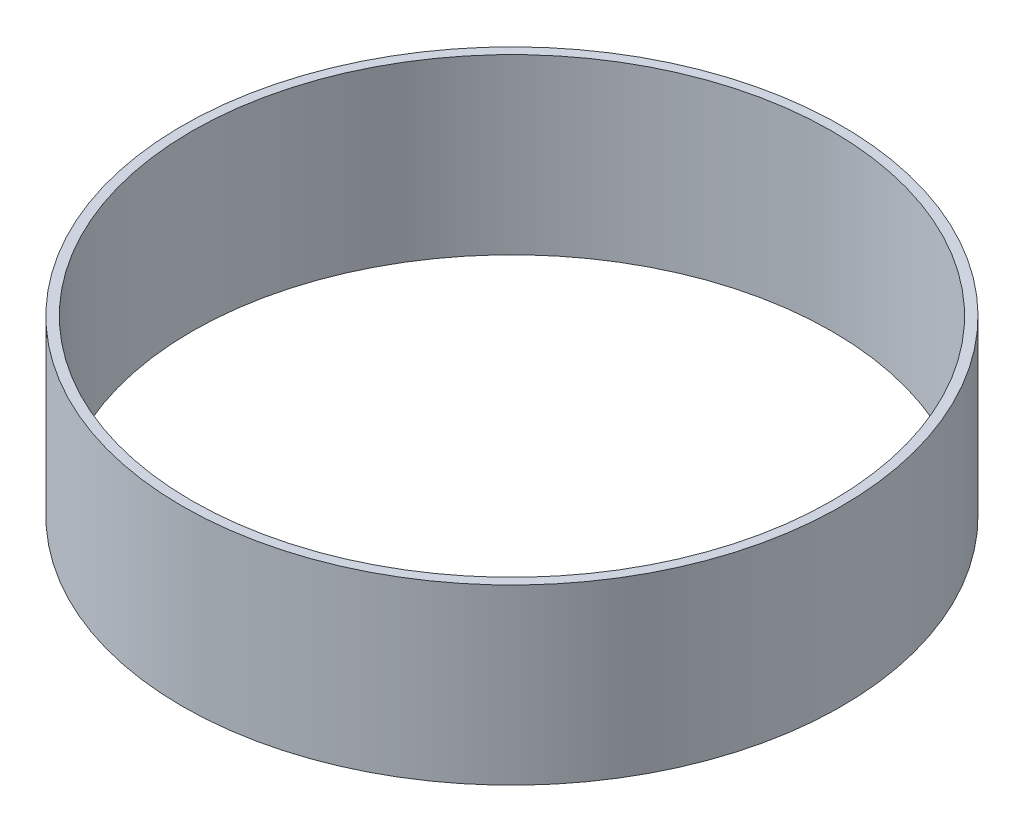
from build123d import *

# Parameters (mm, degrees)
SKETCH2_R           = 33
SKETCH2_R_2         = 32.05
BOSS_EXTRUDE2_DEPTH = 17.36


with BuildPart() as part:
    # Sketch2 → Boss-Extrude2 (new body)
    with BuildSketch(Plane(origin=(0, 0, 0), x_dir=(1, 0, 0), z_dir=(0, 1, 0))):
        with Locations(Location((0, 0, 0), (0, 0, 270))):
            Circle(SKETCH2_R)
        with Locations(Location((0, 0, 0), (0, 0, 270))):
            Circle(SKETCH2_R_2, mode=Mode.SUBTRACT)
    extrude(amount=BOSS_EXTRUDE2_DEPTH)


solid = part.part
